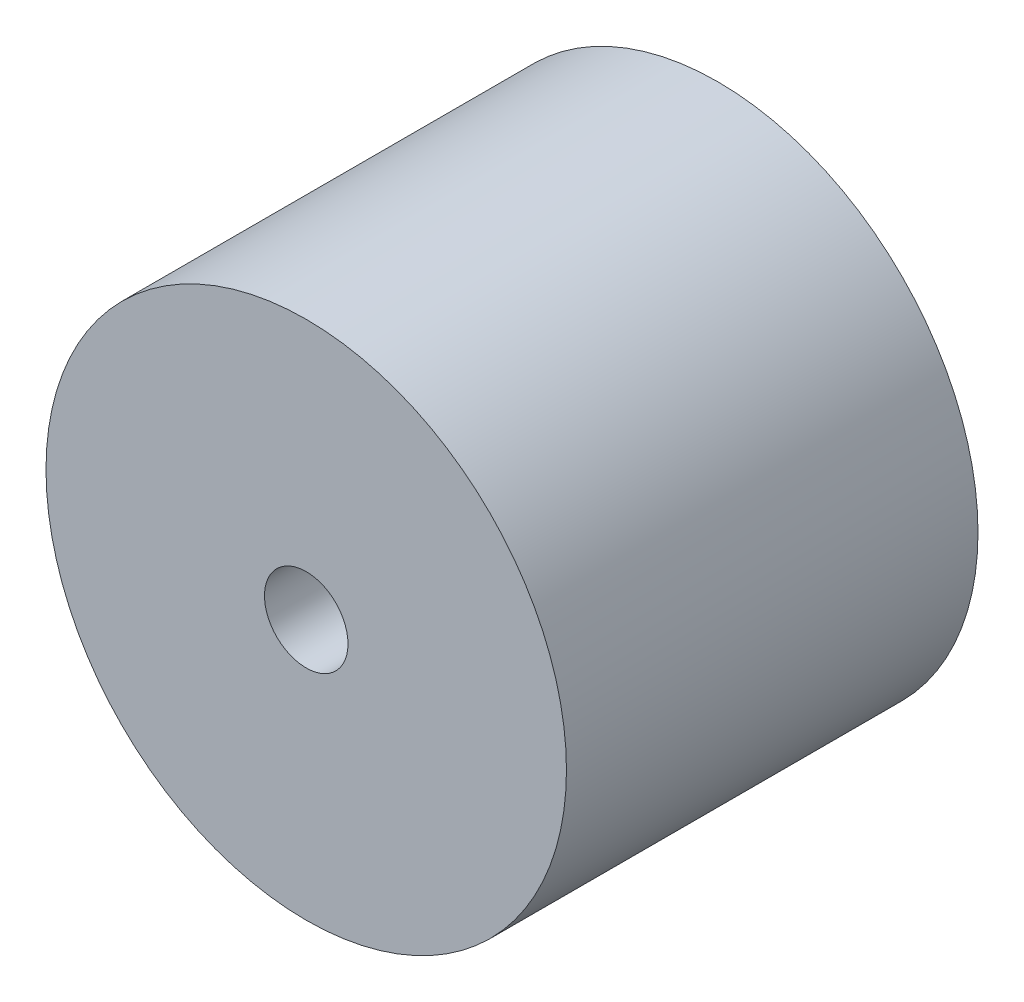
from build123d import *

# Parameters (mm, degrees)
ESQUISSE1_R        = 43
ESQUISSE1_R_2      = 6.9
BOSS_EXTRU_1_DEPTH = 68


with BuildPart() as part:
    # Esquisse1 → Boss.-Extru.1 (new body)
    with BuildSketch(Plane.XY):
        Circle(ESQUISSE1_R)
        Circle(ESQUISSE1_R_2, mode=Mode.SUBTRACT)
    extrude(amount=BOSS_EXTRU_1_DEPTH)


solid = part.part
